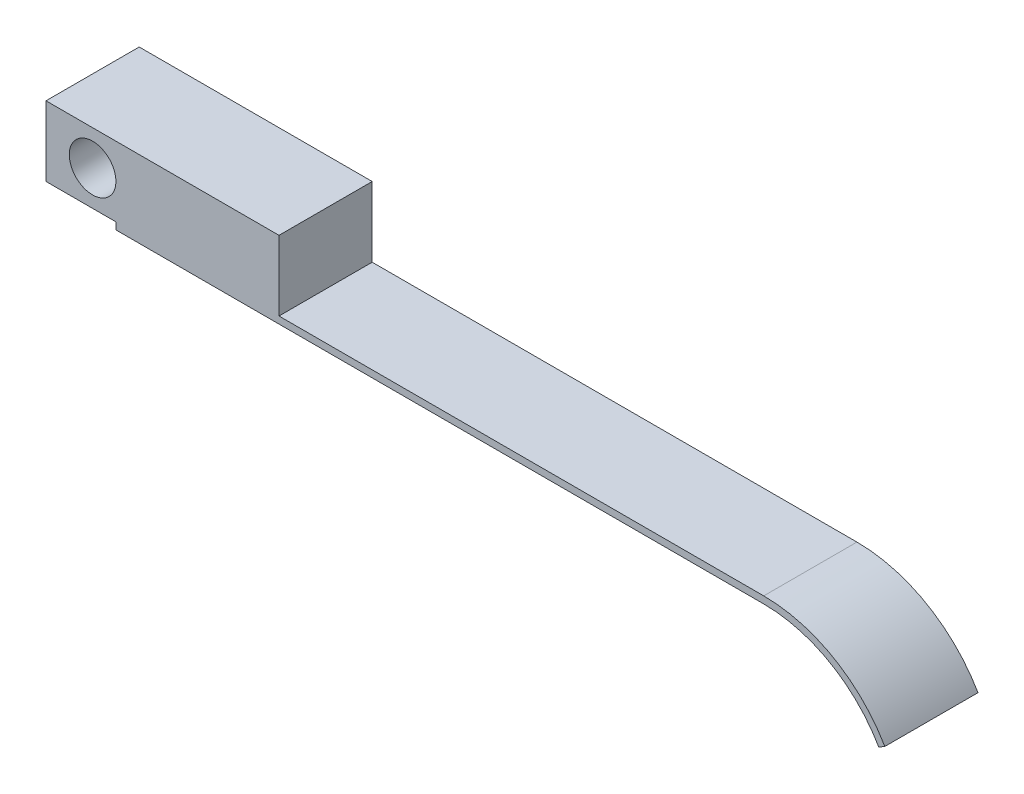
ISO-10303-21;
HEADER;
FILE_DESCRIPTION(('STEP AP214'),'2;1');
FILE_NAME('part.step','',(''),(''),'','','');
FILE_SCHEMA(('AUTOMOTIVE_DESIGN { 1 0 10303 214 1 1 1 1 }'));
ENDSEC;
DATA;
#1=APPLICATION_CONTEXT('core data for automotive mechanical design processes');
#2=APPLICATION_PROTOCOL_DEFINITION('international standard','automotive_design',2000,#1);
#3=PRODUCT_CONTEXT('',#1,'mechanical');
#4=PRODUCT('Part','Part','',(#3));
#5=PRODUCT_RELATED_PRODUCT_CATEGORY('part','',(#4));
#6=PRODUCT_DEFINITION_FORMATION('','',#4);
#7=PRODUCT_DEFINITION_CONTEXT('part definition',#1,'design');
#8=PRODUCT_DEFINITION('design','',#6,#7);
#9=PRODUCT_DEFINITION_SHAPE('','',#8);
#10=(LENGTH_UNIT() NAMED_UNIT(*) SI_UNIT(.MILLI.,.METRE.));
#11=(NAMED_UNIT(*) PLANE_ANGLE_UNIT() SI_UNIT($,.RADIAN.));
#12=(NAMED_UNIT(*) SI_UNIT($,.STERADIAN.) SOLID_ANGLE_UNIT());
#13=UNCERTAINTY_MEASURE_WITH_UNIT(LENGTH_MEASURE(1.E-05),#10,'distance_accuracy_value','');
#14=(GEOMETRIC_REPRESENTATION_CONTEXT(3) GLOBAL_UNCERTAINTY_ASSIGNED_CONTEXT((#13)) GLOBAL_UNIT_ASSIGNED_CONTEXT((#10,
#11,#12)) REPRESENTATION_CONTEXT('',''));
#15=CARTESIAN_POINT('',(0.,0.,0.));
#16=DIRECTION('',(0.,0.,1.));
#17=DIRECTION('',(1.,0.,0.));
#18=AXIS2_PLACEMENT_3D('',#15,#16,#17);
#19=CARTESIAN_POINT('',(0.,15.,20.));
#20=DIRECTION('',(0.,0.,-1.));
#21=DIRECTION('',(-1.,0.,0.));
#22=AXIS2_PLACEMENT_3D('',#19,#20,#21);
#23=PLANE('',#22);
#24=DIRECTION('',(0.,-1.,0.));
#25=VECTOR('',#24,1.);
#26=CARTESIAN_POINT('',(0.,0.,20.));
#27=LINE('',#26,#25);
#28=CARTESIAN_POINT('',(0.,15.,20.));
#29=VERTEX_POINT('',#28);
#30=CARTESIAN_POINT('',(0.,0.,20.));
#31=VERTEX_POINT('',#30);
#32=EDGE_CURVE('E174',#29,#31,#27,.T.);
#33=ORIENTED_EDGE('',*,*,#32,.T.);
#34=DIRECTION('',(1.,0.,0.));
#35=VECTOR('',#34,1.);
#36=CARTESIAN_POINT('',(0.,0.,20.));
#37=LINE('',#36,#35);
#38=CARTESIAN_POINT('',(15.,0.,20.));
#39=VERTEX_POINT('',#38);
#40=EDGE_CURVE('E124',#31,#39,#37,.T.);
#41=ORIENTED_EDGE('',*,*,#40,.T.);
#42=DIRECTION('',(0.,-1.,0.));
#43=VECTOR('',#42,1.);
#44=CARTESIAN_POINT('',(15.,0.,20.));
#45=LINE('',#44,#43);
#46=CARTESIAN_POINT('',(15.,-1.5,20.));
#47=VERTEX_POINT('',#46);
#48=EDGE_CURVE('E105',#39,#47,#45,.T.);
#49=ORIENTED_EDGE('',*,*,#48,.T.);
#50=DIRECTION('',(1.,0.,0.));
#51=VECTOR('',#50,1.);
#52=CARTESIAN_POINT('',(15.,-1.5,20.));
#53=LINE('',#52,#51);
#54=CARTESIAN_POINT('',(154.019237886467,-1.49999999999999,20.));
#55=VERTEX_POINT('',#54);
#56=EDGE_CURVE('E116',#47,#55,#53,.T.);
#57=ORIENTED_EDGE('',*,*,#56,.T.);
#58=CARTESIAN_POINT('',(154.019237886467,-30.,20.));
#59=DIRECTION('',(0.,0.,-1.));
#60=DIRECTION('',(1.,0.,0.));
#61=AXIS2_PLACEMENT_3D('',#58,#59,#60);
#62=CIRCLE('',#61,28.5);
#63=CARTESIAN_POINT('',(178.700961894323,-15.7499999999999,20.));
#64=VERTEX_POINT('',#63);
#65=EDGE_CURVE('E120',#55,#64,#62,.T.);
#66=ORIENTED_EDGE('',*,*,#65,.T.);
#67=DIRECTION('',(0.86602540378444,0.499999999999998,0.));
#68=VECTOR('',#67,1.);
#69=CARTESIAN_POINT('',(178.700961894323,-15.7499999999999,20.));
#70=LINE('',#69,#68);
#71=CARTESIAN_POINT('',(180.,-14.9999999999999,20.));
#72=VERTEX_POINT('',#71);
#73=EDGE_CURVE('E128',#64,#72,#70,.T.);
#74=ORIENTED_EDGE('',*,*,#73,.T.);
#75=CARTESIAN_POINT('',(154.019237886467,-30.,20.));
#76=DIRECTION('',(0.,0.,1.));
#77=DIRECTION('',(1.,0.,0.));
#78=AXIS2_PLACEMENT_3D('',#75,#76,#77);
#79=CIRCLE('',#78,30.);
#80=CARTESIAN_POINT('',(154.019237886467,0.,20.));
#81=VERTEX_POINT('',#80);
#82=EDGE_CURVE('E131',#72,#81,#79,.T.);
#83=ORIENTED_EDGE('',*,*,#82,.T.);
#84=DIRECTION('',(-1.,0.,0.));
#85=VECTOR('',#84,1.);
#86=CARTESIAN_POINT('',(15.,0.,20.));
#87=LINE('',#86,#85);
#88=CARTESIAN_POINT('',(50.,0.,20.));
#89=VERTEX_POINT('',#88);
#90=EDGE_CURVE('E134',#81,#89,#87,.T.);
#91=ORIENTED_EDGE('',*,*,#90,.T.);
#92=DIRECTION('',(0.,1.,0.));
#93=VECTOR('',#92,1.);
#94=CARTESIAN_POINT('',(50.,0.,20.));
#95=LINE('',#94,#93);
#96=CARTESIAN_POINT('',(50.,15.,20.));
#97=VERTEX_POINT('',#96);
#98=EDGE_CURVE('E44',#89,#97,#95,.T.);
#99=ORIENTED_EDGE('',*,*,#98,.T.);
#100=DIRECTION('',(-1.,0.,0.));
#101=VECTOR('',#100,1.);
#102=CARTESIAN_POINT('',(0.,15.,20.));
#103=LINE('',#102,#101);
#104=EDGE_CURVE('E39',#97,#29,#103,.T.);
#105=ORIENTED_EDGE('',*,*,#104,.T.);
#106=EDGE_LOOP('',(#33,#41,#49,#57,#66,#74,#83,#91,#99,#105));
#107=FACE_BOUND('',#106,.T.);
#108=CARTESIAN_POINT('',(10.,7.5,20.));
#109=DIRECTION('',(0.,0.,1.));
#110=DIRECTION('',(1.,0.,0.));
#111=AXIS2_PLACEMENT_3D('',#108,#109,#110);
#112=CIRCLE('',#111,5.);
#113=CARTESIAN_POINT('',(15.,7.5,20.));
#114=VERTEX_POINT('',#113);
#115=EDGE_CURVE('E161',#114,#114,#112,.T.);
#116=ORIENTED_EDGE('',*,*,#115,.F.);
#117=EDGE_LOOP('',(#116));
#118=FACE_BOUND('',#117,.T.);
#119=ADVANCED_FACE('F24',(#107,#118),#23,.F.);
#120=CARTESIAN_POINT('',(0.,15.,0.));
#121=DIRECTION('',(0.,0.,-1.));
#122=DIRECTION('',(-1.,0.,0.));
#123=AXIS2_PLACEMENT_3D('',#120,#121,#122);
#124=PLANE('',#123);
#125=DIRECTION('',(0.,-1.,0.));
#126=VECTOR('',#125,1.);
#127=CARTESIAN_POINT('',(0.,0.,0.));
#128=LINE('',#127,#126);
#129=CARTESIAN_POINT('',(0.,15.,0.));
#130=VERTEX_POINT('',#129);
#131=CARTESIAN_POINT('',(0.,0.,0.));
#132=VERTEX_POINT('',#131);
#133=EDGE_CURVE('E164',#130,#132,#128,.T.);
#134=ORIENTED_EDGE('',*,*,#133,.F.);
#135=DIRECTION('',(-1.,0.,0.));
#136=VECTOR('',#135,1.);
#137=CARTESIAN_POINT('',(0.,15.,0.));
#138=LINE('',#137,#136);
#139=CARTESIAN_POINT('',(50.,15.,0.));
#140=VERTEX_POINT('',#139);
#141=EDGE_CURVE('E172',#140,#130,#138,.T.);
#142=ORIENTED_EDGE('',*,*,#141,.F.);
#143=DIRECTION('',(0.,1.,0.));
#144=VECTOR('',#143,1.);
#145=CARTESIAN_POINT('',(50.,0.,0.));
#146=LINE('',#145,#144);
#147=CARTESIAN_POINT('',(50.,0.,0.));
#148=VERTEX_POINT('',#147);
#149=EDGE_CURVE('E170',#148,#140,#146,.T.);
#150=ORIENTED_EDGE('',*,*,#149,.F.);
#151=DIRECTION('',(-1.,0.,0.));
#152=VECTOR('',#151,1.);
#153=CARTESIAN_POINT('',(15.,0.,0.));
#154=LINE('',#153,#152);
#155=CARTESIAN_POINT('',(154.019237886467,0.,0.));
#156=VERTEX_POINT('',#155);
#157=EDGE_CURVE('E113',#156,#148,#154,.T.);
#158=ORIENTED_EDGE('',*,*,#157,.F.);
#159=CARTESIAN_POINT('',(154.019237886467,-30.,0.));
#160=DIRECTION('',(0.,0.,1.));
#161=DIRECTION('',(1.,0.,0.));
#162=AXIS2_PLACEMENT_3D('',#159,#160,#161);
#163=CIRCLE('',#162,30.);
#164=CARTESIAN_POINT('',(180.,-14.9999999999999,0.));
#165=VERTEX_POINT('',#164);
#166=EDGE_CURVE('E145',#165,#156,#163,.T.);
#167=ORIENTED_EDGE('',*,*,#166,.F.);
#168=DIRECTION('',(0.86602540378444,0.499999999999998,0.));
#169=VECTOR('',#168,1.);
#170=CARTESIAN_POINT('',(178.700961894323,-15.7499999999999,0.));
#171=LINE('',#170,#169);
#172=CARTESIAN_POINT('',(178.700961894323,-15.7499999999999,0.));
#173=VERTEX_POINT('',#172);
#174=EDGE_CURVE('E142',#173,#165,#171,.T.);
#175=ORIENTED_EDGE('',*,*,#174,.F.);
#176=CARTESIAN_POINT('',(154.019237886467,-30.,0.));
#177=DIRECTION('',(0.,0.,-1.));
#178=DIRECTION('',(1.,0.,0.));
#179=AXIS2_PLACEMENT_3D('',#176,#177,#178);
#180=CIRCLE('',#179,28.5);
#181=CARTESIAN_POINT('',(154.019237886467,-1.49999999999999,0.));
#182=VERTEX_POINT('',#181);
#183=EDGE_CURVE('E139',#182,#173,#180,.T.);
#184=ORIENTED_EDGE('',*,*,#183,.F.);
#185=DIRECTION('',(1.,0.,0.));
#186=VECTOR('',#185,1.);
#187=CARTESIAN_POINT('',(15.,-1.5,0.));
#188=LINE('',#187,#186);
#189=CARTESIAN_POINT('',(15.,-1.5,0.));
#190=VERTEX_POINT('',#189);
#191=EDGE_CURVE('E137',#190,#182,#188,.T.);
#192=ORIENTED_EDGE('',*,*,#191,.F.);
#193=DIRECTION('',(0.,-1.,0.));
#194=VECTOR('',#193,1.);
#195=CARTESIAN_POINT('',(15.,0.,0.));
#196=LINE('',#195,#194);
#197=CARTESIAN_POINT('',(15.,0.,0.));
#198=VERTEX_POINT('',#197);
#199=EDGE_CURVE('E108',#198,#190,#196,.T.);
#200=ORIENTED_EDGE('',*,*,#199,.F.);
#201=DIRECTION('',(1.,0.,0.));
#202=VECTOR('',#201,1.);
#203=CARTESIAN_POINT('',(0.,0.,0.));
#204=LINE('',#203,#202);
#205=EDGE_CURVE('E167',#132,#198,#204,.T.);
#206=ORIENTED_EDGE('',*,*,#205,.F.);
#207=EDGE_LOOP('',(#134,#142,#150,#158,#167,#175,#184,#192,#200,#206));
#208=FACE_BOUND('',#207,.T.);
#209=CARTESIAN_POINT('',(10.,7.5,0.));
#210=DIRECTION('',(0.,0.,1.));
#211=DIRECTION('',(1.,0.,0.));
#212=AXIS2_PLACEMENT_3D('',#209,#210,#211);
#213=CIRCLE('',#212,5.);
#214=CARTESIAN_POINT('',(15.,7.5,0.));
#215=VERTEX_POINT('',#214);
#216=EDGE_CURVE('E151',#215,#215,#213,.T.);
#217=ORIENTED_EDGE('',*,*,#216,.T.);
#218=EDGE_LOOP('',(#217));
#219=FACE_BOUND('',#218,.T.);
#220=ADVANCED_FACE('F194',(#208,#219),#124,.T.);
#221=CARTESIAN_POINT('',(0.,0.,20.));
#222=DIRECTION('',(1.,0.,0.));
#223=DIRECTION('',(0.,0.,-1.));
#224=AXIS2_PLACEMENT_3D('',#221,#222,#223);
#225=PLANE('',#224);
#226=ORIENTED_EDGE('',*,*,#133,.T.);
#227=DIRECTION('',(0.,0.,-1.));
#228=VECTOR('',#227,1.);
#229=CARTESIAN_POINT('',(0.,0.,20.));
#230=LINE('',#229,#228);
#231=EDGE_CURVE('E11',#31,#132,#230,.T.);
#232=ORIENTED_EDGE('',*,*,#231,.F.);
#233=ORIENTED_EDGE('',*,*,#32,.F.);
#234=DIRECTION('',(0.,0.,-1.));
#235=VECTOR('',#234,1.);
#236=CARTESIAN_POINT('',(0.,15.,20.));
#237=LINE('',#236,#235);
#238=EDGE_CURVE('E179',#29,#130,#237,.T.);
#239=ORIENTED_EDGE('',*,*,#238,.T.);
#240=EDGE_LOOP('',(#226,#232,#233,#239));
#241=FACE_BOUND('',#240,.T.);
#242=ADVANCED_FACE('F26',(#241),#225,.F.);
#243=CARTESIAN_POINT('',(0.,0.,20.));
#244=DIRECTION('',(0.,1.,0.));
#245=DIRECTION('',(0.,0.,1.));
#246=AXIS2_PLACEMENT_3D('',#243,#244,#245);
#247=PLANE('',#246);
#248=ORIENTED_EDGE('',*,*,#205,.T.);
#249=DIRECTION('',(0.,0.,1.));
#250=VECTOR('',#249,1.);
#251=CARTESIAN_POINT('',(15.,0.,0.));
#252=LINE('',#251,#250);
#253=EDGE_CURVE('E149',#198,#39,#252,.T.);
#254=ORIENTED_EDGE('',*,*,#253,.T.);
#255=ORIENTED_EDGE('',*,*,#40,.F.);
#256=ORIENTED_EDGE('',*,*,#231,.T.);
#257=EDGE_LOOP('',(#248,#254,#255,#256));
#258=FACE_BOUND('',#257,.T.);
#259=ADVANCED_FACE('F203',(#258),#247,.F.);
#260=CARTESIAN_POINT('',(50.,0.,20.));
#261=DIRECTION('',(-1.,0.,0.));
#262=DIRECTION('',(0.,0.,1.));
#263=AXIS2_PLACEMENT_3D('',#260,#261,#262);
#264=PLANE('',#263);
#265=ORIENTED_EDGE('',*,*,#149,.T.);
#266=DIRECTION('',(0.,0.,-1.));
#267=VECTOR('',#266,1.);
#268=CARTESIAN_POINT('',(50.,15.,20.));
#269=LINE('',#268,#267);
#270=EDGE_CURVE('E182',#97,#140,#269,.T.);
#271=ORIENTED_EDGE('',*,*,#270,.F.);
#272=ORIENTED_EDGE('',*,*,#98,.F.);
#273=DIRECTION('',(0.,0.,-1.));
#274=VECTOR('',#273,1.);
#275=CARTESIAN_POINT('',(50.,0.,20.));
#276=LINE('',#275,#274);
#277=EDGE_CURVE('E32',#89,#148,#276,.T.);
#278=ORIENTED_EDGE('',*,*,#277,.T.);
#279=EDGE_LOOP('',(#265,#271,#272,#278));
#280=FACE_BOUND('',#279,.T.);
#281=ADVANCED_FACE('F187',(#280),#264,.F.);
#282=CARTESIAN_POINT('',(0.,15.,20.));
#283=DIRECTION('',(0.,-1.,0.));
#284=DIRECTION('',(0.,0.,-1.));
#285=AXIS2_PLACEMENT_3D('',#282,#283,#284);
#286=PLANE('',#285);
#287=ORIENTED_EDGE('',*,*,#141,.T.);
#288=ORIENTED_EDGE('',*,*,#238,.F.);
#289=ORIENTED_EDGE('',*,*,#104,.F.);
#290=ORIENTED_EDGE('',*,*,#270,.T.);
#291=EDGE_LOOP('',(#287,#288,#289,#290));
#292=FACE_BOUND('',#291,.T.);
#293=ADVANCED_FACE('F198',(#292),#286,.F.);
#294=CARTESIAN_POINT('',(10.,7.5,20.));
#295=DIRECTION('',(0.,0.,-1.));
#296=DIRECTION('',(-1.,0.,0.));
#297=AXIS2_PLACEMENT_3D('',#294,#295,#296);
#298=CYLINDRICAL_SURFACE('',#297,5.);
#299=ORIENTED_EDGE('',*,*,#115,.T.);
#300=EDGE_LOOP('',(#299));
#301=FACE_BOUND('',#300,.T.);
#302=ORIENTED_EDGE('',*,*,#216,.F.);
#303=EDGE_LOOP('',(#302));
#304=FACE_BOUND('',#303,.T.);
#305=ADVANCED_FACE('F216',(#301,#304),#298,.F.);
#306=CARTESIAN_POINT('',(15.,0.,0.));
#307=DIRECTION('',(0.,1.,0.));
#308=DIRECTION('',(-1.,0.,0.));
#309=AXIS2_PLACEMENT_3D('',#306,#307,#308);
#310=PLANE('',#309);
#311=ORIENTED_EDGE('',*,*,#277,.F.);
#312=ORIENTED_EDGE('',*,*,#90,.F.);
#313=DIRECTION('',(0.,0.,1.));
#314=VECTOR('',#313,1.);
#315=CARTESIAN_POINT('',(154.019237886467,0.,0.));
#316=LINE('',#315,#314);
#317=EDGE_CURVE('E152',#156,#81,#316,.T.);
#318=ORIENTED_EDGE('',*,*,#317,.F.);
#319=ORIENTED_EDGE('',*,*,#157,.T.);
#320=EDGE_LOOP('',(#311,#312,#318,#319));
#321=FACE_BOUND('',#320,.T.);
#322=ADVANCED_FACE('F214',(#321),#310,.T.);
#323=CARTESIAN_POINT('',(15.,0.,0.));
#324=DIRECTION('',(-1.,0.,0.));
#325=DIRECTION('',(0.,0.,1.));
#326=AXIS2_PLACEMENT_3D('',#323,#324,#325);
#327=PLANE('',#326);
#328=ORIENTED_EDGE('',*,*,#48,.F.);
#329=ORIENTED_EDGE('',*,*,#253,.F.);
#330=ORIENTED_EDGE('',*,*,#199,.T.);
#331=DIRECTION('',(0.,0.,1.));
#332=VECTOR('',#331,1.);
#333=CARTESIAN_POINT('',(15.,-1.5,0.));
#334=LINE('',#333,#332);
#335=EDGE_CURVE('E101',#190,#47,#334,.T.);
#336=ORIENTED_EDGE('',*,*,#335,.T.);
#337=EDGE_LOOP('',(#328,#329,#330,#336));
#338=FACE_BOUND('',#337,.T.);
#339=ADVANCED_FACE('F103',(#338),#327,.T.);
#340=CARTESIAN_POINT('',(154.019237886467,-30.,0.));
#341=DIRECTION('',(0.,0.,1.));
#342=DIRECTION('',(1.,0.,0.));
#343=AXIS2_PLACEMENT_3D('',#340,#341,#342);
#344=CYLINDRICAL_SURFACE('',#343,30.);
#345=ORIENTED_EDGE('',*,*,#82,.F.);
#346=DIRECTION('',(0.,0.,1.));
#347=VECTOR('',#346,1.);
#348=CARTESIAN_POINT('',(180.,-14.9999999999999,0.));
#349=LINE('',#348,#347);
#350=EDGE_CURVE('E154',#165,#72,#349,.T.);
#351=ORIENTED_EDGE('',*,*,#350,.F.);
#352=ORIENTED_EDGE('',*,*,#166,.T.);
#353=ORIENTED_EDGE('',*,*,#317,.T.);
#354=EDGE_LOOP('',(#345,#351,#352,#353));
#355=FACE_BOUND('',#354,.T.);
#356=ADVANCED_FACE('F213',(#355),#344,.T.);
#357=CARTESIAN_POINT('',(178.700961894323,-15.7499999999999,0.));
#358=DIRECTION('',(0.499999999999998,-0.86602540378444,0.));
#359=DIRECTION('',(0.86602540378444,0.499999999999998,0.));
#360=AXIS2_PLACEMENT_3D('',#357,#358,#359);
#361=PLANE('',#360);
#362=ORIENTED_EDGE('',*,*,#73,.F.);
#363=DIRECTION('',(0.,0.,1.));
#364=VECTOR('',#363,1.);
#365=CARTESIAN_POINT('',(178.700961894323,-15.7499999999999,0.));
#366=LINE('',#365,#364);
#367=EDGE_CURVE('E156',#173,#64,#366,.T.);
#368=ORIENTED_EDGE('',*,*,#367,.F.);
#369=ORIENTED_EDGE('',*,*,#174,.T.);
#370=ORIENTED_EDGE('',*,*,#350,.T.);
#371=EDGE_LOOP('',(#362,#368,#369,#370));
#372=FACE_BOUND('',#371,.T.);
#373=ADVANCED_FACE('F211',(#372),#361,.T.);
#374=CARTESIAN_POINT('',(154.019237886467,-30.,0.));
#375=DIRECTION('',(0.,0.,1.));
#376=DIRECTION('',(1.,0.,0.));
#377=AXIS2_PLACEMENT_3D('',#374,#375,#376);
#378=CYLINDRICAL_SURFACE('',#377,28.5);
#379=ORIENTED_EDGE('',*,*,#65,.F.);
#380=DIRECTION('',(0.,0.,1.));
#381=VECTOR('',#380,1.);
#382=CARTESIAN_POINT('',(154.019237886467,-1.49999999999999,0.));
#383=LINE('',#382,#381);
#384=EDGE_CURVE('E112',#182,#55,#383,.T.);
#385=ORIENTED_EDGE('',*,*,#384,.F.);
#386=ORIENTED_EDGE('',*,*,#183,.T.);
#387=ORIENTED_EDGE('',*,*,#367,.T.);
#388=EDGE_LOOP('',(#379,#385,#386,#387));
#389=FACE_BOUND('',#388,.T.);
#390=ADVANCED_FACE('F207',(#389),#378,.F.);
#391=CARTESIAN_POINT('',(15.,-1.5,0.));
#392=DIRECTION('',(0.,-1.,0.));
#393=DIRECTION('',(1.,0.,0.));
#394=AXIS2_PLACEMENT_3D('',#391,#392,#393);
#395=PLANE('',#394);
#396=ORIENTED_EDGE('',*,*,#56,.F.);
#397=ORIENTED_EDGE('',*,*,#335,.F.);
#398=ORIENTED_EDGE('',*,*,#191,.T.);
#399=ORIENTED_EDGE('',*,*,#384,.T.);
#400=EDGE_LOOP('',(#396,#397,#398,#399));
#401=FACE_BOUND('',#400,.T.);
#402=ADVANCED_FACE('F117',(#401),#395,.T.);
#403=CLOSED_SHELL('',(#119,#220,#242,#259,#281,#293,#305,#322,#339,#356,#373,#390,#402));
#404=MANIFOLD_SOLID_BREP('B2',#403);
#405=ADVANCED_BREP_SHAPE_REPRESENTATION('',(#18,#404),#14);
#406=SHAPE_DEFINITION_REPRESENTATION(#9,#405);
ENDSEC;
END-ISO-10303-21;
